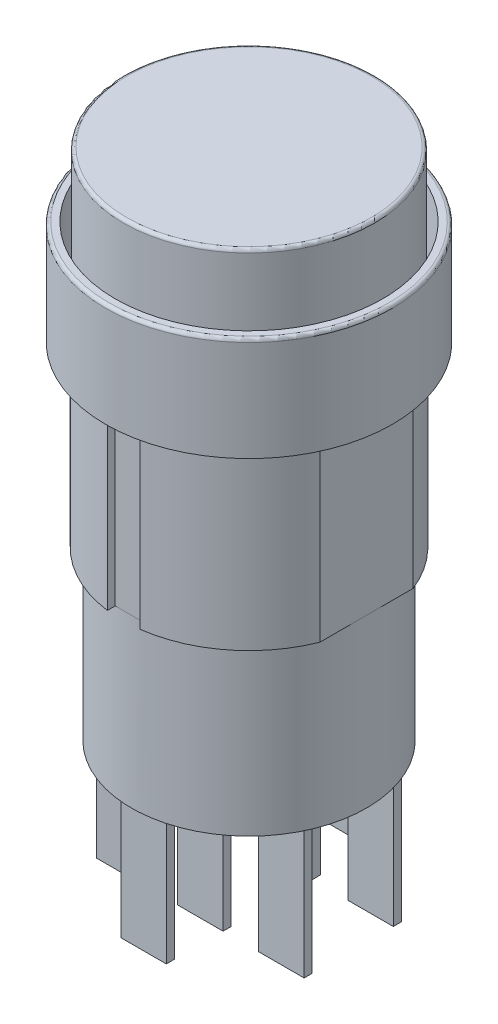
from build123d import *

# Parameters (mm, degrees)
ESBO_O2_R                = 8.85
RESSALTO_EXTRUS_O1_DEPTH = 6.4
ESBO_O3_R                = 8.25
CORTE_EXTRUS_O1_DEPTH    = 5
ESBO_O4_R                = 7.75
RESSALTO_EXTRUS_O2_DEPTH = 9
FILETE1_R                = 0.2
ESBO_O5_R                = 7.8
RESSALTO_EXTRUS_O3_DEPTH = 11
ESBO_O6_R                = 7.25
RESSALTO_EXTRUS_O4_DEPTH = 10.3
ESBO_O7_W                = 21.473826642
ESBO_O7_H                = 23.10287556
CORTE_EXTRUS_O2_DEPTH    = 11
ESBO_O8_W                = 2.8
ESBO_O8_H                = 0.5
RESSALTO_EXTRUS_O5_DEPTH = 8


with BuildPart() as part:
    # Esbo_o2 → Ressalto-extrus_o1 (new body)
    with BuildSketch(Plane(origin=(0, 0, 0), x_dir=(1, 0, 0), z_dir=(0, 1, 0))):
        with Locations(Location((0, 0, 0), (0, 0, 270))):
            Circle(ESBO_O2_R)
    extrude(amount=RESSALTO_EXTRUS_O1_DEPTH)

    # Esbo_o3 → Corte-extrus_o1 (cut)
    with BuildSketch(Plane(origin=(0, 6.4, 0), x_dir=(1, 0, 0), z_dir=(0, 1, 0))):
        with Locations(Location((0, 0, 0), (0, 0, 270))):
            Circle(ESBO_O3_R)
    extrude(amount=-CORTE_EXTRUS_O1_DEPTH, mode=Mode.SUBTRACT)

    # Esbo_o4 → Ressalto-extrus_o2 (add)
    with BuildSketch(Plane(origin=(0, 1.4, 0), x_dir=(1, 0, 0), z_dir=(0, 1, 0))):
        with Locations(Location((0, 0, 0), (0, 0, 270))):
            Circle(ESBO_O4_R)
    extrude(amount=RESSALTO_EXTRUS_O2_DEPTH)

    # Filete1
    filete1_edges = [part.edges().sort_by_distance(p)[0] for p in [
        (0, 10.4, -7.75),
        (0, 6.4, -8.85),
    ]]
    fillet(filete1_edges, radius=FILETE1_R)

    # Esbo_o5 → Ressalto-extrus_o3 (add)
    with BuildSketch(Plane.XZ):
        with Locations(Location((0, 0, 0), (0, 0, 90))):
            Circle(ESBO_O5_R)
    extrude(amount=RESSALTO_EXTRUS_O3_DEPTH)

    # Esbo_o6 → Ressalto-extrus_o4 (add)
    with BuildSketch(Plane.XZ.offset(11)):
        with Locations(Location((0, 0, 0), (0, 0, 90))):
            Circle(ESBO_O6_R)
    extrude(amount=RESSALTO_EXTRUS_O4_DEPTH)

    # Esbo_o7 → Corte-extrus_o2 (cut)
    with BuildSketch(Plane.XZ.offset(11)):
        Rectangle(ESBO_O7_W, ESBO_O7_H)
        Polygon((-7.25, -7.8), (-1, -7.8), (-1, -7.25), (1, -7.25), (1, -7.8), (7.25, -7.8), (7.25, 7.8), (1, 7.8), (1, 7.25), (-1, 7.25), (-1, 7.8), (-7.25, 7.8), align=None, mode=Mode.SUBTRACT)
    extrude(amount=-CORTE_EXTRUS_O2_DEPTH, mode=Mode.SUBTRACT)

    # Esbo_o8 → Ressalto-extrus_o5 (add)
    with BuildSketch(Plane.XZ.offset(21.3)):
        with Locations((-5, 2.75)):
            Rectangle(ESBO_O8_W, ESBO_O8_H)
        with Locations((0, 2.75)):
            Rectangle(ESBO_O8_W, ESBO_O8_H)
        with Locations((5, 2.75)):
            Rectangle(ESBO_O8_W, ESBO_O8_H)
        with Locations((0, 6.25)):
            Rectangle(ESBO_O8_W, ESBO_O8_H)
        with Locations((0, -6.25)):
            Rectangle(ESBO_O8_W, ESBO_O8_H)
        with Locations((5, -2.75)):
            Rectangle(ESBO_O8_W, ESBO_O8_H)
        with Locations((0, -2.75)):
            Rectangle(ESBO_O8_W, ESBO_O8_H)
        with Locations((-5, -2.75)):
            Rectangle(ESBO_O8_W, ESBO_O8_H)
    extrude(amount=RESSALTO_EXTRUS_O5_DEPTH)


solid = part.part
